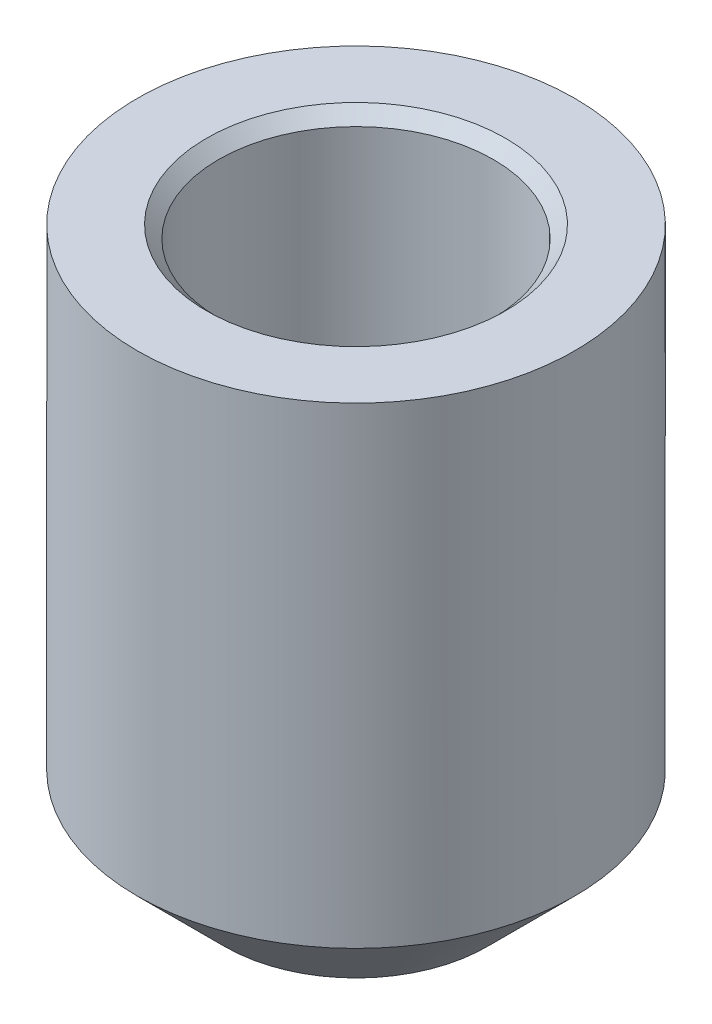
ISO-10303-21;
HEADER;
FILE_DESCRIPTION(('STEP AP214'),'2;1');
FILE_NAME('part.step','',(''),(''),'','','');
FILE_SCHEMA(('AUTOMOTIVE_DESIGN { 1 0 10303 214 1 1 1 1 }'));
ENDSEC;
DATA;
#1=APPLICATION_CONTEXT('core data for automotive mechanical design processes');
#2=APPLICATION_PROTOCOL_DEFINITION('international standard','automotive_design',2000,#1);
#3=PRODUCT_CONTEXT('',#1,'mechanical');
#4=PRODUCT('Part','Part','',(#3));
#5=PRODUCT_RELATED_PRODUCT_CATEGORY('part','',(#4));
#6=PRODUCT_DEFINITION_FORMATION('','',#4);
#7=PRODUCT_DEFINITION_CONTEXT('part definition',#1,'design');
#8=PRODUCT_DEFINITION('design','',#6,#7);
#9=PRODUCT_DEFINITION_SHAPE('','',#8);
#10=(LENGTH_UNIT() NAMED_UNIT(*) SI_UNIT(.MILLI.,.METRE.));
#11=(NAMED_UNIT(*) PLANE_ANGLE_UNIT() SI_UNIT($,.RADIAN.));
#12=(NAMED_UNIT(*) SI_UNIT($,.STERADIAN.) SOLID_ANGLE_UNIT());
#13=UNCERTAINTY_MEASURE_WITH_UNIT(LENGTH_MEASURE(1.E-05),#10,'distance_accuracy_value','');
#14=(GEOMETRIC_REPRESENTATION_CONTEXT(3) GLOBAL_UNCERTAINTY_ASSIGNED_CONTEXT((#13)) GLOBAL_UNIT_ASSIGNED_CONTEXT((#10,
#11,#12)) REPRESENTATION_CONTEXT('',''));
#15=CARTESIAN_POINT('',(0.,0.,0.));
#16=DIRECTION('',(0.,0.,1.));
#17=DIRECTION('',(1.,0.,0.));
#18=AXIS2_PLACEMENT_3D('',#15,#16,#17);
#19=CARTESIAN_POINT('',(4.1402,0.,0.));
#20=DIRECTION('',(0.,-1.,0.));
#21=DIRECTION('',(0.,0.,-1.));
#22=AXIS2_PLACEMENT_3D('',#19,#20,#21);
#23=PLANE('',#22);
#24=CARTESIAN_POINT('',(0.,0.,0.));
#25=DIRECTION('',(0.,-1.,0.));
#26=DIRECTION('',(0.,0.,-1.));
#27=AXIS2_PLACEMENT_3D('',#24,#25,#26);
#28=CIRCLE('',#27,2.1717);
#29=CARTESIAN_POINT('',(0.,0.,-2.17170000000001));
#30=VERTEX_POINT('',#29);
#31=EDGE_CURVE('E41',#30,#30,#28,.T.);
#32=ORIENTED_EDGE('',*,*,#31,.T.);
#33=EDGE_LOOP('',(#32));
#34=FACE_BOUND('',#33,.T.);
#35=CARTESIAN_POINT('',(0.,0.,0.));
#36=DIRECTION('',(0.,-1.,0.));
#37=DIRECTION('',(0.,0.,-1.));
#38=AXIS2_PLACEMENT_3D('',#35,#36,#37);
#39=CIRCLE('',#38,3.17627);
#40=CARTESIAN_POINT('',(0.,0.,-3.17627000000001));
#41=VERTEX_POINT('',#40);
#42=EDGE_CURVE('E56',#41,#41,#39,.T.);
#43=ORIENTED_EDGE('',*,*,#42,.F.);
#44=EDGE_LOOP('',(#43));
#45=FACE_BOUND('',#44,.T.);
#46=ADVANCED_FACE('F31',(#34,#45),#23,.F.);
#47=CARTESIAN_POINT('',(0.,0.,0.));
#48=DIRECTION('',(0.,1.,0.));
#49=DIRECTION('',(0.,0.,1.));
#50=AXIS2_PLACEMENT_3D('',#47,#48,#49);
#51=CYLINDRICAL_SURFACE('',#50,1.9939);
#52=CARTESIAN_POINT('',(0.,-3.3782,0.));
#53=DIRECTION('',(0.,-1.,0.));
#54=DIRECTION('',(0.,0.,-1.));
#55=AXIS2_PLACEMENT_3D('',#52,#53,#54);
#56=CIRCLE('',#55,1.9939);
#57=CARTESIAN_POINT('',(0.,-3.3782,-1.99390000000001));
#58=VERTEX_POINT('',#57);
#59=EDGE_CURVE('E11',#58,#58,#56,.T.);
#60=ORIENTED_EDGE('',*,*,#59,.T.);
#61=EDGE_LOOP('',(#60));
#62=FACE_BOUND('',#61,.T.);
#63=CARTESIAN_POINT('',(0.,-0.177799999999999,0.));
#64=DIRECTION('',(0.,-1.,0.));
#65=DIRECTION('',(0.,0.,-1.));
#66=AXIS2_PLACEMENT_3D('',#63,#64,#65);
#67=CIRCLE('',#66,1.9939);
#68=CARTESIAN_POINT('',(0.,-0.177799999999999,-1.99390000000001));
#69=VERTEX_POINT('',#68);
#70=EDGE_CURVE('E45',#69,#69,#67,.F.);
#71=ORIENTED_EDGE('',*,*,#70,.T.);
#72=EDGE_LOOP('',(#71));
#73=FACE_BOUND('',#72,.T.);
#74=ADVANCED_FACE('F63',(#62,#73),#51,.F.);
#75=CARTESIAN_POINT('',(1.99389999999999,-3.556,0.));
#76=DIRECTION('',(0.,-1.,0.));
#77=DIRECTION('',(0.,0.,-1.));
#78=AXIS2_PLACEMENT_3D('',#75,#76,#77);
#79=PLANE('',#78);
#80=CARTESIAN_POINT('',(0.,-3.556,0.));
#81=DIRECTION('',(0.,-1.,0.));
#82=DIRECTION('',(0.,0.,-1.));
#83=AXIS2_PLACEMENT_3D('',#80,#81,#82);
#84=CIRCLE('',#83,1.8161);
#85=CARTESIAN_POINT('',(0.,-3.556,-1.8161));
#86=VERTEX_POINT('',#85);
#87=EDGE_CURVE('E37',#86,#86,#84,.F.);
#88=ORIENTED_EDGE('',*,*,#87,.T.);
#89=EDGE_LOOP('',(#88));
#90=FACE_BOUND('',#89,.T.);
#91=ADVANCED_FACE('F68',(#90),#79,.F.);
#92=CARTESIAN_POINT('',(0.,-0.177799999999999,0.));
#93=DIRECTION('',(0.,1.,0.));
#94=DIRECTION('',(0.,0.,1.));
#95=AXIS2_PLACEMENT_3D('',#92,#93,#94);
#96=CONICAL_SURFACE('',#95,1.9939,0.78539816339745);
#97=ORIENTED_EDGE('',*,*,#31,.F.);
#98=EDGE_LOOP('',(#97));
#99=FACE_BOUND('',#98,.T.);
#100=ORIENTED_EDGE('',*,*,#70,.F.);
#101=EDGE_LOOP('',(#100));
#102=FACE_BOUND('',#101,.T.);
#103=ADVANCED_FACE('F71',(#99,#102),#96,.F.);
#104=CARTESIAN_POINT('',(-1.52655665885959E-13,-8.128,0.));
#105=DIRECTION('',(0.,1.,0.));
#106=DIRECTION('',(0.,0.,1.));
#107=AXIS2_PLACEMENT_3D('',#104,#105,#106);
#108=PLANE('',#107);
#109=CARTESIAN_POINT('',(-1.66533453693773E-13,-8.128,0.));
#110=DIRECTION('',(0.,1.,0.));
#111=DIRECTION('',(0.,0.,1.));
#112=AXIS2_PLACEMENT_3D('',#109,#110,#111);
#113=CIRCLE('',#112,1.90627);
#114=CARTESIAN_POINT('',(-1.66533454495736E-13,-8.128,1.90626999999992));
#115=VERTEX_POINT('',#114);
#116=EDGE_CURVE('E50',#115,#115,#113,.F.);
#117=ORIENTED_EDGE('',*,*,#116,.T.);
#118=EDGE_LOOP('',(#117));
#119=FACE_BOUND('',#118,.T.);
#120=ADVANCED_FACE('F74',(#119),#108,.F.);
#121=CARTESIAN_POINT('',(0.,-6.858,0.));
#122=DIRECTION('',(0.,1.,0.));
#123=DIRECTION('',(0.,0.,1.));
#124=AXIS2_PLACEMENT_3D('',#121,#122,#123);
#125=CONICAL_SURFACE('',#124,3.17627,0.78539816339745);
#126=ORIENTED_EDGE('',*,*,#116,.F.);
#127=EDGE_LOOP('',(#126));
#128=FACE_BOUND('',#127,.T.);
#129=CARTESIAN_POINT('',(0.,-6.858,0.));
#130=DIRECTION('',(0.,1.,0.));
#131=DIRECTION('',(0.,0.,1.));
#132=AXIS2_PLACEMENT_3D('',#129,#130,#131);
#133=CIRCLE('',#132,3.17627);
#134=CARTESIAN_POINT('',(0.,-6.858,3.17627000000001));
#135=VERTEX_POINT('',#134);
#136=EDGE_CURVE('E53',#135,#135,#133,.T.);
#137=ORIENTED_EDGE('',*,*,#136,.F.);
#138=EDGE_LOOP('',(#137));
#139=FACE_BOUND('',#138,.T.);
#140=ADVANCED_FACE('F82',(#128,#139),#125,.T.);
#141=CARTESIAN_POINT('',(0.,0.,0.));
#142=DIRECTION('',(0.,1.,0.));
#143=DIRECTION('',(0.,0.,1.));
#144=AXIS2_PLACEMENT_3D('',#141,#142,#143);
#145=CYLINDRICAL_SURFACE('',#144,3.17627);
#146=ORIENTED_EDGE('',*,*,#136,.T.);
#147=EDGE_LOOP('',(#146));
#148=FACE_BOUND('',#147,.T.);
#149=ORIENTED_EDGE('',*,*,#42,.T.);
#150=EDGE_LOOP('',(#149));
#151=FACE_BOUND('',#150,.T.);
#152=ADVANCED_FACE('F60',(#148,#151),#145,.T.);
#153=CARTESIAN_POINT('',(0.,-3.556,0.));
#154=DIRECTION('',(0.,1.,0.));
#155=DIRECTION('',(0.,0.,1.));
#156=AXIS2_PLACEMENT_3D('',#153,#154,#155);
#157=CONICAL_SURFACE('',#156,1.8161,0.785398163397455);
#158=ORIENTED_EDGE('',*,*,#59,.F.);
#159=EDGE_LOOP('',(#158));
#160=FACE_BOUND('',#159,.T.);
#161=ORIENTED_EDGE('',*,*,#87,.F.);
#162=EDGE_LOOP('',(#161));
#163=FACE_BOUND('',#162,.T.);
#164=ADVANCED_FACE('F88',(#160,#163),#157,.F.);
#165=CLOSED_SHELL('',(#46,#74,#91,#103,#120,#140,#152,#164));
#166=MANIFOLD_SOLID_BREP('B2',#165);
#167=ADVANCED_BREP_SHAPE_REPRESENTATION('',(#18,#166),#14);
#168=SHAPE_DEFINITION_REPRESENTATION(#9,#167);
ENDSEC;
END-ISO-10303-21;
